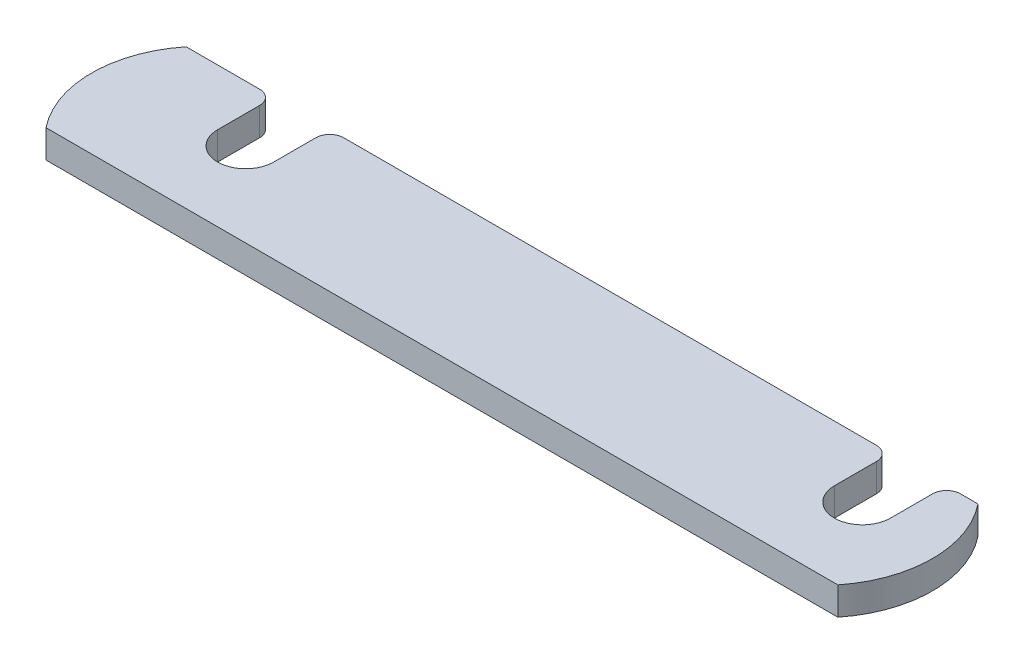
ISO-10303-21;
HEADER;
FILE_DESCRIPTION(('STEP AP214'),'2;1');
FILE_NAME('part.step','',(''),(''),'','','');
FILE_SCHEMA(('AUTOMOTIVE_DESIGN { 1 0 10303 214 1 1 1 1 }'));
ENDSEC;
DATA;
#1=APPLICATION_CONTEXT('core data for automotive mechanical design processes');
#2=APPLICATION_PROTOCOL_DEFINITION('international standard','automotive_design',2000,#1);
#3=PRODUCT_CONTEXT('',#1,'mechanical');
#4=PRODUCT('Part','Part','',(#3));
#5=PRODUCT_RELATED_PRODUCT_CATEGORY('part','',(#4));
#6=PRODUCT_DEFINITION_FORMATION('','',#4);
#7=PRODUCT_DEFINITION_CONTEXT('part definition',#1,'design');
#8=PRODUCT_DEFINITION('design','',#6,#7);
#9=PRODUCT_DEFINITION_SHAPE('','',#8);
#10=(LENGTH_UNIT() NAMED_UNIT(*) SI_UNIT(.MILLI.,.METRE.));
#11=(NAMED_UNIT(*) PLANE_ANGLE_UNIT() SI_UNIT($,.RADIAN.));
#12=(NAMED_UNIT(*) SI_UNIT($,.STERADIAN.) SOLID_ANGLE_UNIT());
#13=UNCERTAINTY_MEASURE_WITH_UNIT(LENGTH_MEASURE(1.E-05),#10,'distance_accuracy_value','');
#14=(GEOMETRIC_REPRESENTATION_CONTEXT(3) GLOBAL_UNCERTAINTY_ASSIGNED_CONTEXT((#13)) GLOBAL_UNIT_ASSIGNED_CONTEXT((#10,
#11,#12)) REPRESENTATION_CONTEXT('',''));
#15=CARTESIAN_POINT('',(0.,0.,0.));
#16=DIRECTION('',(0.,0.,1.));
#17=DIRECTION('',(1.,0.,0.));
#18=AXIS2_PLACEMENT_3D('',#15,#16,#17);
#19=CARTESIAN_POINT('',(27.,2.,-4.));
#20=DIRECTION('',(0.,-1.,0.));
#21=DIRECTION('',(0.,0.,-1.));
#22=AXIS2_PLACEMENT_3D('',#19,#20,#21);
#23=CYLINDRICAL_SURFACE('',#22,1.);
#24=CARTESIAN_POINT('',(27.,0.,-4.));
#25=DIRECTION('',(0.,1.,0.));
#26=DIRECTION('',(0.,0.,-1.));
#27=AXIS2_PLACEMENT_3D('',#24,#25,#26);
#28=CIRCLE('',#27,1.);
#29=CARTESIAN_POINT('',(27.,0.,-5.));
#30=VERTEX_POINT('',#29);
#31=CARTESIAN_POINT('',(26.,0.,-3.99999999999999));
#32=VERTEX_POINT('',#31);
#33=EDGE_CURVE('E178',#30,#32,#28,.T.);
#34=ORIENTED_EDGE('',*,*,#33,.T.);
#35=DIRECTION('',(0.,-1.,0.));
#36=VECTOR('',#35,1.);
#37=CARTESIAN_POINT('',(26.,2.,-3.99999999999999));
#38=LINE('',#37,#36);
#39=CARTESIAN_POINT('',(26.,2.,-3.99999999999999));
#40=VERTEX_POINT('',#39);
#41=EDGE_CURVE('E11',#40,#32,#38,.T.);
#42=ORIENTED_EDGE('',*,*,#41,.F.);
#43=CARTESIAN_POINT('',(27.,2.,-4.));
#44=DIRECTION('',(0.,1.,0.));
#45=DIRECTION('',(0.,0.,-1.));
#46=AXIS2_PLACEMENT_3D('',#43,#44,#45);
#47=CIRCLE('',#46,1.);
#48=CARTESIAN_POINT('',(27.,2.,-5.));
#49=VERTEX_POINT('',#48);
#50=EDGE_CURVE('E208',#49,#40,#47,.T.);
#51=ORIENTED_EDGE('',*,*,#50,.F.);
#52=DIRECTION('',(0.,-1.,0.));
#53=VECTOR('',#52,1.);
#54=CARTESIAN_POINT('',(27.,2.,-5.));
#55=LINE('',#54,#53);
#56=EDGE_CURVE('E174',#49,#30,#55,.T.);
#57=ORIENTED_EDGE('',*,*,#56,.T.);
#58=EDGE_LOOP('',(#34,#42,#51,#57));
#59=FACE_BOUND('',#58,.T.);
#60=ADVANCED_FACE('F34',(#59),#23,.T.);
#61=CARTESIAN_POINT('',(26.,2.,-3.99999999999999));
#62=DIRECTION('',(1.,0.,0.));
#63=DIRECTION('',(0.,0.,-1.));
#64=AXIS2_PLACEMENT_3D('',#61,#62,#63);
#65=PLANE('',#64);
#66=DIRECTION('',(0.,0.,1.));
#67=VECTOR('',#66,1.);
#68=CARTESIAN_POINT('',(26.,0.,-3.99999999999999));
#69=LINE('',#68,#67);
#70=CARTESIAN_POINT('',(26.,0.,-0.999999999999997));
#71=VERTEX_POINT('',#70);
#72=EDGE_CURVE('E181',#32,#71,#69,.T.);
#73=ORIENTED_EDGE('',*,*,#72,.T.);
#74=DIRECTION('',(0.,-1.,0.));
#75=VECTOR('',#74,1.);
#76=CARTESIAN_POINT('',(26.,2.,-0.999999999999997));
#77=LINE('',#76,#75);
#78=CARTESIAN_POINT('',(26.,2.,-0.999999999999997));
#79=VERTEX_POINT('',#78);
#80=EDGE_CURVE('E42',#79,#71,#77,.T.);
#81=ORIENTED_EDGE('',*,*,#80,.F.);
#82=DIRECTION('',(0.,0.,1.));
#83=VECTOR('',#82,1.);
#84=CARTESIAN_POINT('',(26.,2.,-3.99999999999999));
#85=LINE('',#84,#83);
#86=EDGE_CURVE('E117',#40,#79,#85,.T.);
#87=ORIENTED_EDGE('',*,*,#86,.F.);
#88=ORIENTED_EDGE('',*,*,#41,.T.);
#89=EDGE_LOOP('',(#73,#81,#87,#88));
#90=FACE_BOUND('',#89,.T.);
#91=ADVANCED_FACE('F306',(#90),#65,.F.);
#92=CARTESIAN_POINT('',(24.,2.,-0.999999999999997));
#93=DIRECTION('',(0.,-1.,0.));
#94=DIRECTION('',(0.,0.,-1.));
#95=AXIS2_PLACEMENT_3D('',#92,#93,#94);
#96=CYLINDRICAL_SURFACE('',#95,2.);
#97=CARTESIAN_POINT('',(24.,0.,-0.999999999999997));
#98=DIRECTION('',(0.,-1.,0.));
#99=DIRECTION('',(0.,0.,1.));
#100=AXIS2_PLACEMENT_3D('',#97,#98,#99);
#101=CIRCLE('',#100,2.);
#102=CARTESIAN_POINT('',(22.,0.,-0.999999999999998));
#103=VERTEX_POINT('',#102);
#104=EDGE_CURVE('E183',#71,#103,#101,.T.);
#105=ORIENTED_EDGE('',*,*,#104,.T.);
#106=DIRECTION('',(0.,-1.,0.));
#107=VECTOR('',#106,1.);
#108=CARTESIAN_POINT('',(22.,2.,-0.999999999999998));
#109=LINE('',#108,#107);
#110=CARTESIAN_POINT('',(22.,2.,-0.999999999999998));
#111=VERTEX_POINT('',#110);
#112=EDGE_CURVE('E239',#111,#103,#109,.T.);
#113=ORIENTED_EDGE('',*,*,#112,.F.);
#114=CARTESIAN_POINT('',(24.,2.,-0.999999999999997));
#115=DIRECTION('',(0.,-1.,0.));
#116=DIRECTION('',(0.,0.,1.));
#117=AXIS2_PLACEMENT_3D('',#114,#115,#116);
#118=CIRCLE('',#117,2.);
#119=EDGE_CURVE('E247',#79,#111,#118,.T.);
#120=ORIENTED_EDGE('',*,*,#119,.F.);
#121=ORIENTED_EDGE('',*,*,#80,.T.);
#122=EDGE_LOOP('',(#105,#113,#120,#121));
#123=FACE_BOUND('',#122,.T.);
#124=ADVANCED_FACE('F245',(#123),#96,.F.);
#125=CARTESIAN_POINT('',(22.,2.,-3.99999999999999));
#126=DIRECTION('',(-1.,0.,0.));
#127=DIRECTION('',(0.,0.,1.));
#128=AXIS2_PLACEMENT_3D('',#125,#126,#127);
#129=PLANE('',#128);
#130=DIRECTION('',(0.,0.,-1.));
#131=VECTOR('',#130,1.);
#132=CARTESIAN_POINT('',(22.,0.,-3.99999999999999));
#133=LINE('',#132,#131);
#134=CARTESIAN_POINT('',(22.,0.,-3.99999999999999));
#135=VERTEX_POINT('',#134);
#136=EDGE_CURVE('E185',#103,#135,#133,.T.);
#137=ORIENTED_EDGE('',*,*,#136,.T.);
#138=DIRECTION('',(0.,-1.,0.));
#139=VECTOR('',#138,1.);
#140=CARTESIAN_POINT('',(22.,2.,-3.99999999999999));
#141=LINE('',#140,#139);
#142=CARTESIAN_POINT('',(22.,2.,-3.99999999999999));
#143=VERTEX_POINT('',#142);
#144=EDGE_CURVE('E236',#143,#135,#141,.T.);
#145=ORIENTED_EDGE('',*,*,#144,.F.);
#146=DIRECTION('',(0.,0.,-1.));
#147=VECTOR('',#146,1.);
#148=CARTESIAN_POINT('',(22.,2.,-3.99999999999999));
#149=LINE('',#148,#147);
#150=EDGE_CURVE('E265',#111,#143,#149,.T.);
#151=ORIENTED_EDGE('',*,*,#150,.F.);
#152=ORIENTED_EDGE('',*,*,#112,.T.);
#153=EDGE_LOOP('',(#137,#145,#151,#152));
#154=FACE_BOUND('',#153,.T.);
#155=ADVANCED_FACE('F256',(#154),#129,.F.);
#156=CARTESIAN_POINT('',(21.,2.,-4.));
#157=DIRECTION('',(0.,-1.,0.));
#158=DIRECTION('',(0.,0.,-1.));
#159=AXIS2_PLACEMENT_3D('',#156,#157,#158);
#160=CYLINDRICAL_SURFACE('',#159,1.);
#161=CARTESIAN_POINT('',(21.,0.,-4.));
#162=DIRECTION('',(0.,1.,0.));
#163=DIRECTION('',(0.,0.,1.));
#164=AXIS2_PLACEMENT_3D('',#161,#162,#163);
#165=CIRCLE('',#164,1.);
#166=CARTESIAN_POINT('',(21.,0.,-5.));
#167=VERTEX_POINT('',#166);
#168=EDGE_CURVE('E187',#135,#167,#165,.T.);
#169=ORIENTED_EDGE('',*,*,#168,.T.);
#170=DIRECTION('',(0.,-1.,0.));
#171=VECTOR('',#170,1.);
#172=CARTESIAN_POINT('',(21.,2.,-5.));
#173=LINE('',#172,#171);
#174=CARTESIAN_POINT('',(21.,2.,-5.));
#175=VERTEX_POINT('',#174);
#176=EDGE_CURVE('E233',#175,#167,#173,.T.);
#177=ORIENTED_EDGE('',*,*,#176,.F.);
#178=CARTESIAN_POINT('',(21.,2.,-4.));
#179=DIRECTION('',(0.,1.,0.));
#180=DIRECTION('',(0.,0.,1.));
#181=AXIS2_PLACEMENT_3D('',#178,#179,#180);
#182=CIRCLE('',#181,1.);
#183=EDGE_CURVE('E262',#143,#175,#182,.T.);
#184=ORIENTED_EDGE('',*,*,#183,.F.);
#185=ORIENTED_EDGE('',*,*,#144,.T.);
#186=EDGE_LOOP('',(#169,#177,#184,#185));
#187=FACE_BOUND('',#186,.T.);
#188=ADVANCED_FACE('F260',(#187),#160,.T.);
#189=CARTESIAN_POINT('',(-17.,2.,-5.));
#190=DIRECTION('',(0.,0.,1.));
#191=DIRECTION('',(1.,0.,0.));
#192=AXIS2_PLACEMENT_3D('',#189,#190,#191);
#193=PLANE('',#192);
#194=DIRECTION('',(-1.,0.,0.));
#195=VECTOR('',#194,1.);
#196=CARTESIAN_POINT('',(-17.,0.,-5.));
#197=LINE('',#196,#195);
#198=CARTESIAN_POINT('',(-17.,0.,-5.));
#199=VERTEX_POINT('',#198);
#200=EDGE_CURVE('E189',#167,#199,#197,.T.);
#201=ORIENTED_EDGE('',*,*,#200,.T.);
#202=DIRECTION('',(0.,-1.,0.));
#203=VECTOR('',#202,1.);
#204=CARTESIAN_POINT('',(-17.,2.,-5.));
#205=LINE('',#204,#203);
#206=CARTESIAN_POINT('',(-17.,2.,-5.));
#207=VERTEX_POINT('',#206);
#208=EDGE_CURVE('E230',#207,#199,#205,.T.);
#209=ORIENTED_EDGE('',*,*,#208,.F.);
#210=DIRECTION('',(-1.,0.,0.));
#211=VECTOR('',#210,1.);
#212=CARTESIAN_POINT('',(-17.,2.,-5.));
#213=LINE('',#212,#211);
#214=EDGE_CURVE('E264',#175,#207,#213,.T.);
#215=ORIENTED_EDGE('',*,*,#214,.F.);
#216=ORIENTED_EDGE('',*,*,#176,.T.);
#217=EDGE_LOOP('',(#201,#209,#215,#216));
#218=FACE_BOUND('',#217,.T.);
#219=ADVANCED_FACE('F319',(#218),#193,.F.);
#220=CARTESIAN_POINT('',(-17.,2.,-4.));
#221=DIRECTION('',(0.,-1.,0.));
#222=DIRECTION('',(0.,0.,-1.));
#223=AXIS2_PLACEMENT_3D('',#220,#221,#222);
#224=CYLINDRICAL_SURFACE('',#223,1.);
#225=CARTESIAN_POINT('',(-17.,0.,-4.));
#226=DIRECTION('',(0.,1.,0.));
#227=DIRECTION('',(0.,0.,-1.));
#228=AXIS2_PLACEMENT_3D('',#225,#226,#227);
#229=CIRCLE('',#228,1.);
#230=CARTESIAN_POINT('',(-18.,0.,-3.99999999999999));
#231=VERTEX_POINT('',#230);
#232=EDGE_CURVE('E191',#199,#231,#229,.T.);
#233=ORIENTED_EDGE('',*,*,#232,.T.);
#234=DIRECTION('',(0.,-1.,0.));
#235=VECTOR('',#234,1.);
#236=CARTESIAN_POINT('',(-18.,2.,-3.99999999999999));
#237=LINE('',#236,#235);
#238=CARTESIAN_POINT('',(-18.,2.,-3.99999999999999));
#239=VERTEX_POINT('',#238);
#240=EDGE_CURVE('E227',#239,#231,#237,.T.);
#241=ORIENTED_EDGE('',*,*,#240,.F.);
#242=CARTESIAN_POINT('',(-17.,2.,-4.));
#243=DIRECTION('',(0.,1.,0.));
#244=DIRECTION('',(0.,0.,-1.));
#245=AXIS2_PLACEMENT_3D('',#242,#243,#244);
#246=CIRCLE('',#245,1.);
#247=EDGE_CURVE('E267',#207,#239,#246,.T.);
#248=ORIENTED_EDGE('',*,*,#247,.F.);
#249=ORIENTED_EDGE('',*,*,#208,.T.);
#250=EDGE_LOOP('',(#233,#241,#248,#249));
#251=FACE_BOUND('',#250,.T.);
#252=ADVANCED_FACE('F322',(#251),#224,.T.);
#253=CARTESIAN_POINT('',(-18.,2.,-3.99999999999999));
#254=DIRECTION('',(1.,0.,0.));
#255=DIRECTION('',(0.,0.,-1.));
#256=AXIS2_PLACEMENT_3D('',#253,#254,#255);
#257=PLANE('',#256);
#258=DIRECTION('',(0.,0.,1.));
#259=VECTOR('',#258,1.);
#260=CARTESIAN_POINT('',(-18.,0.,-3.99999999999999));
#261=LINE('',#260,#259);
#262=CARTESIAN_POINT('',(-18.,0.,-0.999999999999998));
#263=VERTEX_POINT('',#262);
#264=EDGE_CURVE('E193',#231,#263,#261,.T.);
#265=ORIENTED_EDGE('',*,*,#264,.T.);
#266=DIRECTION('',(0.,-1.,0.));
#267=VECTOR('',#266,1.);
#268=CARTESIAN_POINT('',(-18.,2.,-0.999999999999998));
#269=LINE('',#268,#267);
#270=CARTESIAN_POINT('',(-18.,2.,-0.999999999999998));
#271=VERTEX_POINT('',#270);
#272=EDGE_CURVE('E224',#271,#263,#269,.T.);
#273=ORIENTED_EDGE('',*,*,#272,.F.);
#274=DIRECTION('',(0.,0.,1.));
#275=VECTOR('',#274,1.);
#276=CARTESIAN_POINT('',(-18.,2.,-3.99999999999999));
#277=LINE('',#276,#275);
#278=EDGE_CURVE('E273',#239,#271,#277,.T.);
#279=ORIENTED_EDGE('',*,*,#278,.F.);
#280=ORIENTED_EDGE('',*,*,#240,.T.);
#281=EDGE_LOOP('',(#265,#273,#279,#280));
#282=FACE_BOUND('',#281,.T.);
#283=ADVANCED_FACE('F326',(#282),#257,.F.);
#284=CARTESIAN_POINT('',(-20.,2.,-0.999999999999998));
#285=DIRECTION('',(0.,-1.,0.));
#286=DIRECTION('',(0.,0.,-1.));
#287=AXIS2_PLACEMENT_3D('',#284,#285,#286);
#288=CYLINDRICAL_SURFACE('',#287,2.00000000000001);
#289=CARTESIAN_POINT('',(-20.,0.,-0.999999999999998));
#290=DIRECTION('',(0.,-1.,0.));
#291=DIRECTION('',(0.,0.,1.));
#292=AXIS2_PLACEMENT_3D('',#289,#290,#291);
#293=CIRCLE('',#292,2.00000000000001);
#294=CARTESIAN_POINT('',(-22.,0.,-0.999999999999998));
#295=VERTEX_POINT('',#294);
#296=EDGE_CURVE('E195',#263,#295,#293,.T.);
#297=ORIENTED_EDGE('',*,*,#296,.T.);
#298=DIRECTION('',(0.,-1.,0.));
#299=VECTOR('',#298,1.);
#300=CARTESIAN_POINT('',(-22.,2.,-0.999999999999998));
#301=LINE('',#300,#299);
#302=CARTESIAN_POINT('',(-22.,2.,-0.999999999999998));
#303=VERTEX_POINT('',#302);
#304=EDGE_CURVE('E221',#303,#295,#301,.T.);
#305=ORIENTED_EDGE('',*,*,#304,.F.);
#306=CARTESIAN_POINT('',(-20.,2.,-0.999999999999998));
#307=DIRECTION('',(0.,-1.,0.));
#308=DIRECTION('',(0.,0.,1.));
#309=AXIS2_PLACEMENT_3D('',#306,#307,#308);
#310=CIRCLE('',#309,2.00000000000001);
#311=EDGE_CURVE('E275',#271,#303,#310,.T.);
#312=ORIENTED_EDGE('',*,*,#311,.F.);
#313=ORIENTED_EDGE('',*,*,#272,.T.);
#314=EDGE_LOOP('',(#297,#305,#312,#313));
#315=FACE_BOUND('',#314,.T.);
#316=ADVANCED_FACE('F330',(#315),#288,.F.);
#317=CARTESIAN_POINT('',(-22.,2.,-3.99999999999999));
#318=DIRECTION('',(-1.,0.,0.));
#319=DIRECTION('',(0.,0.,1.));
#320=AXIS2_PLACEMENT_3D('',#317,#318,#319);
#321=PLANE('',#320);
#322=DIRECTION('',(0.,0.,-1.));
#323=VECTOR('',#322,1.);
#324=CARTESIAN_POINT('',(-22.,0.,-3.99999999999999));
#325=LINE('',#324,#323);
#326=CARTESIAN_POINT('',(-22.,0.,-3.99999999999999));
#327=VERTEX_POINT('',#326);
#328=EDGE_CURVE('E197',#295,#327,#325,.T.);
#329=ORIENTED_EDGE('',*,*,#328,.T.);
#330=DIRECTION('',(0.,-1.,0.));
#331=VECTOR('',#330,1.);
#332=CARTESIAN_POINT('',(-22.,2.,-3.99999999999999));
#333=LINE('',#332,#331);
#334=CARTESIAN_POINT('',(-22.,2.,-3.99999999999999));
#335=VERTEX_POINT('',#334);
#336=EDGE_CURVE('E218',#335,#327,#333,.T.);
#337=ORIENTED_EDGE('',*,*,#336,.F.);
#338=DIRECTION('',(0.,0.,-1.));
#339=VECTOR('',#338,1.);
#340=CARTESIAN_POINT('',(-22.,2.,-3.99999999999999));
#341=LINE('',#340,#339);
#342=EDGE_CURVE('E277',#303,#335,#341,.T.);
#343=ORIENTED_EDGE('',*,*,#342,.F.);
#344=ORIENTED_EDGE('',*,*,#304,.T.);
#345=EDGE_LOOP('',(#329,#337,#343,#344));
#346=FACE_BOUND('',#345,.T.);
#347=ADVANCED_FACE('F334',(#346),#321,.F.);
#348=CARTESIAN_POINT('',(-23.,2.,-4.));
#349=DIRECTION('',(0.,-1.,0.));
#350=DIRECTION('',(0.,0.,-1.));
#351=AXIS2_PLACEMENT_3D('',#348,#349,#350);
#352=CYLINDRICAL_SURFACE('',#351,1.);
#353=CARTESIAN_POINT('',(-23.,0.,-4.));
#354=DIRECTION('',(0.,1.,0.));
#355=DIRECTION('',(0.,0.,1.));
#356=AXIS2_PLACEMENT_3D('',#353,#354,#355);
#357=CIRCLE('',#356,1.);
#358=CARTESIAN_POINT('',(-23.,0.,-5.));
#359=VERTEX_POINT('',#358);
#360=EDGE_CURVE('E199',#327,#359,#357,.T.);
#361=ORIENTED_EDGE('',*,*,#360,.T.);
#362=DIRECTION('',(0.,-1.,0.));
#363=VECTOR('',#362,1.);
#364=CARTESIAN_POINT('',(-23.,2.,-5.));
#365=LINE('',#364,#363);
#366=CARTESIAN_POINT('',(-23.,2.,-5.));
#367=VERTEX_POINT('',#366);
#368=EDGE_CURVE('E215',#367,#359,#365,.T.);
#369=ORIENTED_EDGE('',*,*,#368,.F.);
#370=CARTESIAN_POINT('',(-23.,2.,-4.));
#371=DIRECTION('',(0.,1.,0.));
#372=DIRECTION('',(0.,0.,1.));
#373=AXIS2_PLACEMENT_3D('',#370,#371,#372);
#374=CIRCLE('',#373,1.);
#375=EDGE_CURVE('E279',#335,#367,#374,.T.);
#376=ORIENTED_EDGE('',*,*,#375,.F.);
#377=ORIENTED_EDGE('',*,*,#336,.T.);
#378=EDGE_LOOP('',(#361,#369,#376,#377));
#379=FACE_BOUND('',#378,.T.);
#380=ADVANCED_FACE('F338',(#379),#352,.T.);
#381=CARTESIAN_POINT('',(-28.2449979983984,2.,-5.));
#382=DIRECTION('',(0.,0.,1.));
#383=DIRECTION('',(1.,0.,0.));
#384=AXIS2_PLACEMENT_3D('',#381,#382,#383);
#385=PLANE('',#384);
#386=DIRECTION('',(-1.,0.,0.));
#387=VECTOR('',#386,1.);
#388=CARTESIAN_POINT('',(-28.2449979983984,0.,-5.));
#389=LINE('',#388,#387);
#390=CARTESIAN_POINT('',(-28.2449979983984,0.,-5.));
#391=VERTEX_POINT('',#390);
#392=EDGE_CURVE('E201',#359,#391,#389,.T.);
#393=ORIENTED_EDGE('',*,*,#392,.T.);
#394=DIRECTION('',(0.,-1.,0.));
#395=VECTOR('',#394,1.);
#396=CARTESIAN_POINT('',(-28.2449979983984,2.,-5.));
#397=LINE('',#396,#395);
#398=CARTESIAN_POINT('',(-28.2449979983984,2.,-5.));
#399=VERTEX_POINT('',#398);
#400=EDGE_CURVE('E212',#399,#391,#397,.T.);
#401=ORIENTED_EDGE('',*,*,#400,.F.);
#402=DIRECTION('',(-1.,0.,0.));
#403=VECTOR('',#402,1.);
#404=CARTESIAN_POINT('',(-28.2449979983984,2.,-5.));
#405=LINE('',#404,#403);
#406=EDGE_CURVE('E281',#367,#399,#405,.T.);
#407=ORIENTED_EDGE('',*,*,#406,.F.);
#408=ORIENTED_EDGE('',*,*,#368,.T.);
#409=EDGE_LOOP('',(#393,#401,#407,#408));
#410=FACE_BOUND('',#409,.T.);
#411=ADVANCED_FACE('F287',(#410),#385,.F.);
#412=CARTESIAN_POINT('',(-22.,2.,0.));
#413=DIRECTION('',(0.,-1.,0.));
#414=DIRECTION('',(0.,0.,-1.));
#415=AXIS2_PLACEMENT_3D('',#412,#413,#414);
#416=CYLINDRICAL_SURFACE('',#415,8.);
#417=CARTESIAN_POINT('',(-22.,0.,0.));
#418=DIRECTION('',(0.,1.,0.));
#419=DIRECTION('',(0.,0.,1.));
#420=AXIS2_PLACEMENT_3D('',#417,#418,#419);
#421=CIRCLE('',#420,8.);
#422=CARTESIAN_POINT('',(-28.2449979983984,0.,5.));
#423=VERTEX_POINT('',#422);
#424=EDGE_CURVE('E203',#391,#423,#421,.T.);
#425=ORIENTED_EDGE('',*,*,#424,.T.);
#426=DIRECTION('',(0.,-1.,0.));
#427=VECTOR('',#426,1.);
#428=CARTESIAN_POINT('',(-28.2449979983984,2.,5.));
#429=LINE('',#428,#427);
#430=CARTESIAN_POINT('',(-28.2449979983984,2.,5.));
#431=VERTEX_POINT('',#430);
#432=EDGE_CURVE('E169',#431,#423,#429,.T.);
#433=ORIENTED_EDGE('',*,*,#432,.F.);
#434=CARTESIAN_POINT('',(-22.,2.,0.));
#435=DIRECTION('',(0.,1.,0.));
#436=DIRECTION('',(0.,0.,1.));
#437=AXIS2_PLACEMENT_3D('',#434,#435,#436);
#438=CIRCLE('',#437,8.);
#439=EDGE_CURVE('E160',#399,#431,#438,.T.);
#440=ORIENTED_EDGE('',*,*,#439,.F.);
#441=ORIENTED_EDGE('',*,*,#400,.T.);
#442=EDGE_LOOP('',(#425,#433,#440,#441));
#443=FACE_BOUND('',#442,.T.);
#444=ADVANCED_FACE('F291',(#443),#416,.T.);
#445=CARTESIAN_POINT('',(-28.2449979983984,2.,5.));
#446=DIRECTION('',(0.,0.,-1.));
#447=DIRECTION('',(-1.,0.,0.));
#448=AXIS2_PLACEMENT_3D('',#445,#446,#447);
#449=PLANE('',#448);
#450=DIRECTION('',(1.,0.,0.));
#451=VECTOR('',#450,1.);
#452=CARTESIAN_POINT('',(-28.2449979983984,0.,5.));
#453=LINE('',#452,#451);
#454=CARTESIAN_POINT('',(28.2449979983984,0.,5.));
#455=VERTEX_POINT('',#454);
#456=EDGE_CURVE('E168',#423,#455,#453,.T.);
#457=ORIENTED_EDGE('',*,*,#456,.T.);
#458=DIRECTION('',(0.,-1.,0.));
#459=VECTOR('',#458,1.);
#460=CARTESIAN_POINT('',(28.2449979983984,2.,5.));
#461=LINE('',#460,#459);
#462=CARTESIAN_POINT('',(28.2449979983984,2.,5.));
#463=VERTEX_POINT('',#462);
#464=EDGE_CURVE('E165',#463,#455,#461,.T.);
#465=ORIENTED_EDGE('',*,*,#464,.F.);
#466=DIRECTION('',(1.,0.,0.));
#467=VECTOR('',#466,1.);
#468=CARTESIAN_POINT('',(-28.2449979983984,2.,5.));
#469=LINE('',#468,#467);
#470=EDGE_CURVE('E154',#431,#463,#469,.T.);
#471=ORIENTED_EDGE('',*,*,#470,.F.);
#472=ORIENTED_EDGE('',*,*,#432,.T.);
#473=EDGE_LOOP('',(#457,#465,#471,#472));
#474=FACE_BOUND('',#473,.T.);
#475=ADVANCED_FACE('F166',(#474),#449,.F.);
#476=CARTESIAN_POINT('',(22.,2.,0.));
#477=DIRECTION('',(0.,-1.,0.));
#478=DIRECTION('',(0.,0.,-1.));
#479=AXIS2_PLACEMENT_3D('',#476,#477,#478);
#480=CYLINDRICAL_SURFACE('',#479,8.);
#481=CARTESIAN_POINT('',(22.,0.,0.));
#482=DIRECTION('',(0.,1.,0.));
#483=DIRECTION('',(0.,0.,-1.));
#484=AXIS2_PLACEMENT_3D('',#481,#482,#483);
#485=CIRCLE('',#484,8.);
#486=CARTESIAN_POINT('',(28.2449979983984,0.,-5.));
#487=VERTEX_POINT('',#486);
#488=EDGE_CURVE('E103',#455,#487,#485,.T.);
#489=ORIENTED_EDGE('',*,*,#488,.T.);
#490=DIRECTION('',(0.,-1.,0.));
#491=VECTOR('',#490,1.);
#492=CARTESIAN_POINT('',(28.2449979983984,2.,-5.));
#493=LINE('',#492,#491);
#494=CARTESIAN_POINT('',(28.2449979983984,2.,-5.));
#495=VERTEX_POINT('',#494);
#496=EDGE_CURVE('E170',#495,#487,#493,.T.);
#497=ORIENTED_EDGE('',*,*,#496,.F.);
#498=CARTESIAN_POINT('',(22.,2.,0.));
#499=DIRECTION('',(0.,1.,0.));
#500=DIRECTION('',(0.,0.,-1.));
#501=AXIS2_PLACEMENT_3D('',#498,#499,#500);
#502=CIRCLE('',#501,8.);
#503=EDGE_CURVE('E158',#463,#495,#502,.T.);
#504=ORIENTED_EDGE('',*,*,#503,.F.);
#505=ORIENTED_EDGE('',*,*,#464,.T.);
#506=EDGE_LOOP('',(#489,#497,#504,#505));
#507=FACE_BOUND('',#506,.T.);
#508=ADVANCED_FACE('F172',(#507),#480,.T.);
#509=CARTESIAN_POINT('',(27.,2.,-5.));
#510=DIRECTION('',(0.,0.,1.));
#511=DIRECTION('',(1.,0.,0.));
#512=AXIS2_PLACEMENT_3D('',#509,#510,#511);
#513=PLANE('',#512);
#514=DIRECTION('',(-1.,0.,0.));
#515=VECTOR('',#514,1.);
#516=CARTESIAN_POINT('',(27.,0.,-5.));
#517=LINE('',#516,#515);
#518=EDGE_CURVE('E109',#487,#30,#517,.T.);
#519=ORIENTED_EDGE('',*,*,#518,.T.);
#520=ORIENTED_EDGE('',*,*,#56,.F.);
#521=DIRECTION('',(-1.,0.,0.));
#522=VECTOR('',#521,1.);
#523=CARTESIAN_POINT('',(27.,2.,-5.));
#524=LINE('',#523,#522);
#525=EDGE_CURVE('E50',#495,#49,#524,.T.);
#526=ORIENTED_EDGE('',*,*,#525,.F.);
#527=ORIENTED_EDGE('',*,*,#496,.T.);
#528=EDGE_LOOP('',(#519,#520,#526,#527));
#529=FACE_BOUND('',#528,.T.);
#530=ADVANCED_FACE('F295',(#529),#513,.F.);
#531=CARTESIAN_POINT('',(27.,2.,-4.));
#532=DIRECTION('',(0.,-1.,0.));
#533=DIRECTION('',(0.,0.,-1.));
#534=AXIS2_PLACEMENT_3D('',#531,#532,#533);
#535=PLANE('',#534);
#536=ORIENTED_EDGE('',*,*,#50,.T.);
#537=ORIENTED_EDGE('',*,*,#86,.T.);
#538=ORIENTED_EDGE('',*,*,#119,.T.);
#539=ORIENTED_EDGE('',*,*,#150,.T.);
#540=ORIENTED_EDGE('',*,*,#183,.T.);
#541=ORIENTED_EDGE('',*,*,#214,.T.);
#542=ORIENTED_EDGE('',*,*,#247,.T.);
#543=ORIENTED_EDGE('',*,*,#278,.T.);
#544=ORIENTED_EDGE('',*,*,#311,.T.);
#545=ORIENTED_EDGE('',*,*,#342,.T.);
#546=ORIENTED_EDGE('',*,*,#375,.T.);
#547=ORIENTED_EDGE('',*,*,#406,.T.);
#548=ORIENTED_EDGE('',*,*,#439,.T.);
#549=ORIENTED_EDGE('',*,*,#470,.T.);
#550=ORIENTED_EDGE('',*,*,#503,.T.);
#551=ORIENTED_EDGE('',*,*,#525,.T.);
#552=EDGE_LOOP('',(#536,#537,#538,#539,#540,#541,#542,#543,#544,#545,#546,#547,#548,#549,#550,#551));
#553=FACE_BOUND('',#552,.T.);
#554=ADVANCED_FACE('F156',(#553),#535,.F.);
#555=CARTESIAN_POINT('',(27.,0.,-4.));
#556=DIRECTION('',(0.,-1.,0.));
#557=DIRECTION('',(0.,0.,-1.));
#558=AXIS2_PLACEMENT_3D('',#555,#556,#557);
#559=PLANE('',#558);
#560=ORIENTED_EDGE('',*,*,#33,.F.);
#561=ORIENTED_EDGE('',*,*,#518,.F.);
#562=ORIENTED_EDGE('',*,*,#488,.F.);
#563=ORIENTED_EDGE('',*,*,#456,.F.);
#564=ORIENTED_EDGE('',*,*,#424,.F.);
#565=ORIENTED_EDGE('',*,*,#392,.F.);
#566=ORIENTED_EDGE('',*,*,#360,.F.);
#567=ORIENTED_EDGE('',*,*,#328,.F.);
#568=ORIENTED_EDGE('',*,*,#296,.F.);
#569=ORIENTED_EDGE('',*,*,#264,.F.);
#570=ORIENTED_EDGE('',*,*,#232,.F.);
#571=ORIENTED_EDGE('',*,*,#200,.F.);
#572=ORIENTED_EDGE('',*,*,#168,.F.);
#573=ORIENTED_EDGE('',*,*,#136,.F.);
#574=ORIENTED_EDGE('',*,*,#104,.F.);
#575=ORIENTED_EDGE('',*,*,#72,.F.);
#576=EDGE_LOOP('',(#560,#561,#562,#563,#564,#565,#566,#567,#568,#569,#570,#571,#572,#573,#574,#575));
#577=FACE_BOUND('',#576,.T.);
#578=ADVANCED_FACE('F251',(#577),#559,.T.);
#579=CLOSED_SHELL('',(#60,#91,#124,#155,#188,#219,#252,#283,#316,#347,#380,#411,#444,#475,#508,
#530,#554,#578));
#580=MANIFOLD_SOLID_BREP('B2',#579);
#581=ADVANCED_BREP_SHAPE_REPRESENTATION('',(#18,#580),#14);
#582=SHAPE_DEFINITION_REPRESENTATION(#9,#581);
ENDSEC;
END-ISO-10303-21;
